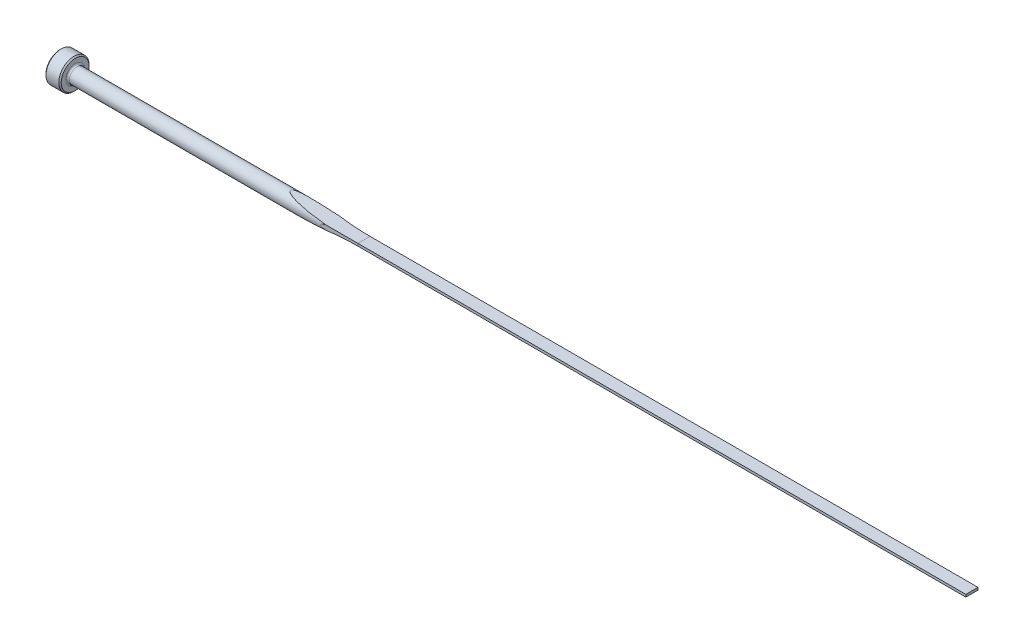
from build123d import *

# Parameters (mm, degrees)
CUT_EXTRUDE1_DEPTH = 191.552909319
CUT_EXTRUDE2_DEPTH = 191.552909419
FILLET1_R          = 0.381
CHAMFER1_SIZE      = 0.254


with BuildPart() as part:
    # Sketch1 → Revolve1 (revolve)
    with BuildSketch(Plane.XY, mode=Mode.PRIVATE) as revolve1_sk:
        Polygon((0, 0), (0, 3.175), (3.175, 3.175), (3.175, 1.5875), (190.5, 1.5875), (190.5, 0), align=None)
    revolve(revolve1_sk.sketch.rotate(Axis((0, 0, 0), (1, 0, 0)), 90), axis=Axis((0, 0, 0), (1, 0, 0)))

    # Sketch2 → Cut-Extrude1 (cut, symmetric)
    with BuildSketch(Plane.XY):
        with BuildLine():
            Line((190.5, 1.5875), (190.5, 0.254))
            Line((190.5, 0.254), (63.5, 0.254))
            ThreePointArc((63.5, 0.254), (55.80103416, 0.588002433), (48.159919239, 1.5875))
            Line((48.159919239, 1.5875), (190.5, 1.5875))
        make_face()
    cut_extrude1 = extrude(amount=CUT_EXTRUDE1_DEPTH, both=True, mode=Mode.SUBTRACT)

    # Mirror1: Cut-Extrude1 across plane
    add(cut_extrude1.mirror(Plane.ZX), mode=Mode.SUBTRACT)

    # Sketch3 → Cut-Extrude2 (cut, symmetric)
    with BuildSketch(Plane(origin=(0, 0, 0), x_dir=(1, 0, 0), z_dir=(0, 1, 0))):
        with BuildLine():
            Line((190.5, 1.5875), (190.5, 1.27))
            Line((190.5, 1.27), (63.5, 1.27))
            ThreePointArc((63.5, 1.27), (59.743289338, 1.349410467), (55.993290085, 1.5875))
            Line((55.993290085, 1.5875), (190.5, 1.5875))
        make_face()
    cut_extrude2 = extrude(amount=CUT_EXTRUDE2_DEPTH, both=True, mode=Mode.SUBTRACT)

    # Mirror2: Cut-Extrude2 across plane
    add(cut_extrude2.mirror(Plane.XY), mode=Mode.SUBTRACT)

    # Fillet1
    fillet1_edges = [part.edges().sort_by_distance(p)[0] for p in [
        (3.175, 0, -1.5875),
    ]]
    fillet(fillet1_edges, radius=FILLET1_R)

    # Chamfer1
    chamfer1_edges = [part.edges().sort_by_distance(p)[0] for p in [
        (3.175, 0, -3.175),
        (0, 0, -3.175),
    ]]
    chamfer(chamfer1_edges, length=CHAMFER1_SIZE)


solid = part.part
